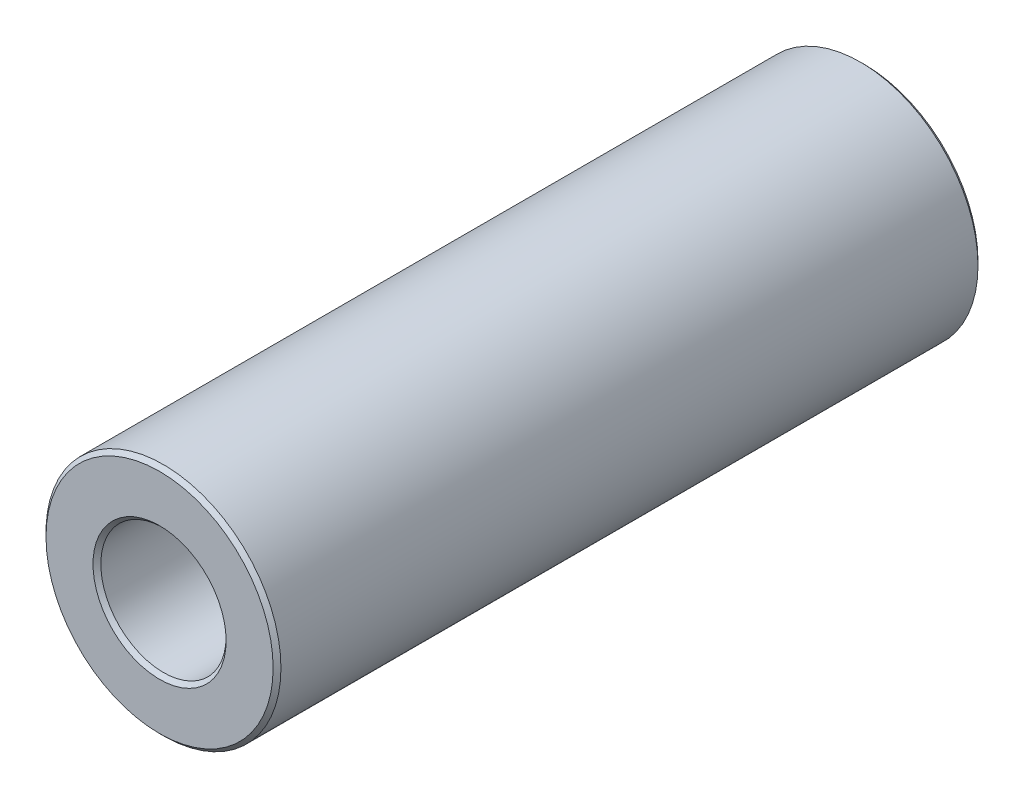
ISO-10303-21;
HEADER;
FILE_DESCRIPTION(('STEP AP214'),'2;1');
FILE_NAME('part.step','',(''),(''),'','','');
FILE_SCHEMA(('AUTOMOTIVE_DESIGN { 1 0 10303 214 1 1 1 1 }'));
ENDSEC;
DATA;
#1=APPLICATION_CONTEXT('core data for automotive mechanical design processes');
#2=APPLICATION_PROTOCOL_DEFINITION('international standard','automotive_design',2000,#1);
#3=PRODUCT_CONTEXT('',#1,'mechanical');
#4=PRODUCT('Part','Part','',(#3));
#5=PRODUCT_RELATED_PRODUCT_CATEGORY('part','',(#4));
#6=PRODUCT_DEFINITION_FORMATION('','',#4);
#7=PRODUCT_DEFINITION_CONTEXT('part definition',#1,'design');
#8=PRODUCT_DEFINITION('design','',#6,#7);
#9=PRODUCT_DEFINITION_SHAPE('','',#8);
#10=(LENGTH_UNIT() NAMED_UNIT(*) SI_UNIT(.MILLI.,.METRE.));
#11=(NAMED_UNIT(*) PLANE_ANGLE_UNIT() SI_UNIT($,.RADIAN.));
#12=(NAMED_UNIT(*) SI_UNIT($,.STERADIAN.) SOLID_ANGLE_UNIT());
#13=UNCERTAINTY_MEASURE_WITH_UNIT(LENGTH_MEASURE(1.E-05),#10,'distance_accuracy_value','');
#14=(GEOMETRIC_REPRESENTATION_CONTEXT(3) GLOBAL_UNCERTAINTY_ASSIGNED_CONTEXT((#13)) GLOBAL_UNIT_ASSIGNED_CONTEXT((#10,
#11,#12)) REPRESENTATION_CONTEXT('',''));
#15=CARTESIAN_POINT('',(0.,0.,0.));
#16=DIRECTION('',(0.,0.,1.));
#17=DIRECTION('',(1.,0.,0.));
#18=AXIS2_PLACEMENT_3D('',#15,#16,#17);
#19=CARTESIAN_POINT('',(0.,0.,9.));
#20=DIRECTION('',(0.,0.,1.));
#21=DIRECTION('',(1.,0.,0.));
#22=AXIS2_PLACEMENT_3D('',#19,#20,#21);
#23=PLANE('',#22);
#24=CARTESIAN_POINT('',(0.,0.,9.));
#25=DIRECTION('',(0.,0.,1.));
#26=DIRECTION('',(1.,0.,0.));
#27=AXIS2_PLACEMENT_3D('',#24,#25,#26);
#28=CIRCLE('',#27,1.7);
#29=CARTESIAN_POINT('',(1.7,0.,9.));
#30=VERTEX_POINT('',#29);
#31=EDGE_CURVE('E10',#30,#30,#28,.F.);
#32=ORIENTED_EDGE('',*,*,#31,.T.);
#33=EDGE_LOOP('',(#32));
#34=FACE_BOUND('',#33,.T.);
#35=CARTESIAN_POINT('',(0.,0.,9.));
#36=DIRECTION('',(0.,0.,1.));
#37=DIRECTION('',(1.,0.,0.));
#38=AXIS2_PLACEMENT_3D('',#35,#36,#37);
#39=CIRCLE('',#38,2.9);
#40=CARTESIAN_POINT('',(2.9,0.,9.));
#41=VERTEX_POINT('',#40);
#42=EDGE_CURVE('E45',#41,#41,#39,.T.);
#43=ORIENTED_EDGE('',*,*,#42,.T.);
#44=EDGE_LOOP('',(#43));
#45=FACE_BOUND('',#44,.T.);
#46=ADVANCED_FACE('F37',(#34,#45),#23,.T.);
#47=CARTESIAN_POINT('',(0.,0.,-9.));
#48=DIRECTION('',(0.,0.,1.));
#49=DIRECTION('',(1.,0.,0.));
#50=AXIS2_PLACEMENT_3D('',#47,#48,#49);
#51=PLANE('',#50);
#52=CARTESIAN_POINT('',(0.,0.,-9.));
#53=DIRECTION('',(0.,0.,1.));
#54=DIRECTION('',(1.,0.,0.));
#55=AXIS2_PLACEMENT_3D('',#52,#53,#54);
#56=CIRCLE('',#55,2.9);
#57=CARTESIAN_POINT('',(2.9,0.,-9.));
#58=VERTEX_POINT('',#57);
#59=EDGE_CURVE('E61',#58,#58,#56,.F.);
#60=ORIENTED_EDGE('',*,*,#59,.T.);
#61=EDGE_LOOP('',(#60));
#62=FACE_BOUND('',#61,.T.);
#63=CARTESIAN_POINT('',(0.,0.,-9.));
#64=DIRECTION('',(0.,0.,1.));
#65=DIRECTION('',(1.,0.,0.));
#66=AXIS2_PLACEMENT_3D('',#63,#64,#65);
#67=CIRCLE('',#66,1.7);
#68=CARTESIAN_POINT('',(1.7,0.,-9.));
#69=VERTEX_POINT('',#68);
#70=EDGE_CURVE('E65',#69,#69,#67,.T.);
#71=ORIENTED_EDGE('',*,*,#70,.T.);
#72=EDGE_LOOP('',(#71));
#73=FACE_BOUND('',#72,.T.);
#74=ADVANCED_FACE('F89',(#62,#73),#51,.F.);
#75=CARTESIAN_POINT('',(0.,0.,9.));
#76=DIRECTION('',(0.,0.,-1.));
#77=DIRECTION('',(-1.,0.,0.));
#78=AXIS2_PLACEMENT_3D('',#75,#76,#77);
#79=CYLINDRICAL_SURFACE('',#78,3.);
#80=CARTESIAN_POINT('',(0.,0.,-8.9));
#81=DIRECTION('',(0.,0.,1.));
#82=DIRECTION('',(1.,0.,0.));
#83=AXIS2_PLACEMENT_3D('',#80,#81,#82);
#84=CIRCLE('',#83,3.);
#85=CARTESIAN_POINT('',(3.,0.,-8.9));
#86=VERTEX_POINT('',#85);
#87=EDGE_CURVE('E69',#86,#86,#84,.T.);
#88=ORIENTED_EDGE('',*,*,#87,.T.);
#89=EDGE_LOOP('',(#88));
#90=FACE_BOUND('',#89,.T.);
#91=CARTESIAN_POINT('',(0.,0.,8.9));
#92=DIRECTION('',(0.,0.,1.));
#93=DIRECTION('',(1.,0.,0.));
#94=AXIS2_PLACEMENT_3D('',#91,#92,#93);
#95=CIRCLE('',#94,3.);
#96=CARTESIAN_POINT('',(3.,0.,8.9));
#97=VERTEX_POINT('',#96);
#98=EDGE_CURVE('E73',#97,#97,#95,.F.);
#99=ORIENTED_EDGE('',*,*,#98,.T.);
#100=EDGE_LOOP('',(#99));
#101=FACE_BOUND('',#100,.T.);
#102=ADVANCED_FACE('F78',(#90,#101),#79,.T.);
#103=CARTESIAN_POINT('',(0.,0.,9.));
#104=DIRECTION('',(0.,0.,-1.));
#105=DIRECTION('',(-1.,0.,0.));
#106=AXIS2_PLACEMENT_3D('',#103,#104,#105);
#107=CYLINDRICAL_SURFACE('',#106,1.6);
#108=CARTESIAN_POINT('',(0.,0.,-8.9));
#109=DIRECTION('',(0.,0.,1.));
#110=DIRECTION('',(1.,0.,0.));
#111=AXIS2_PLACEMENT_3D('',#108,#109,#110);
#112=CIRCLE('',#111,1.6);
#113=CARTESIAN_POINT('',(1.6,0.,-8.9));
#114=VERTEX_POINT('',#113);
#115=EDGE_CURVE('E51',#114,#114,#112,.F.);
#116=ORIENTED_EDGE('',*,*,#115,.T.);
#117=EDGE_LOOP('',(#116));
#118=FACE_BOUND('',#117,.T.);
#119=CARTESIAN_POINT('',(0.,0.,8.9));
#120=DIRECTION('',(0.,0.,1.));
#121=DIRECTION('',(1.,0.,0.));
#122=AXIS2_PLACEMENT_3D('',#119,#120,#121);
#123=CIRCLE('',#122,1.6);
#124=CARTESIAN_POINT('',(1.6,0.,8.9));
#125=VERTEX_POINT('',#124);
#126=EDGE_CURVE('E56',#125,#125,#123,.T.);
#127=ORIENTED_EDGE('',*,*,#126,.T.);
#128=EDGE_LOOP('',(#127));
#129=FACE_BOUND('',#128,.T.);
#130=ADVANCED_FACE('F97',(#118,#129),#107,.F.);
#131=CARTESIAN_POINT('',(0.,0.,-8.9));
#132=DIRECTION('',(0.,0.,1.));
#133=DIRECTION('',(1.,0.,0.));
#134=AXIS2_PLACEMENT_3D('',#131,#132,#133);
#135=CONICAL_SURFACE('',#134,3.,0.785398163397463);
#136=ORIENTED_EDGE('',*,*,#59,.F.);
#137=EDGE_LOOP('',(#136));
#138=FACE_BOUND('',#137,.T.);
#139=ORIENTED_EDGE('',*,*,#87,.F.);
#140=EDGE_LOOP('',(#139));
#141=FACE_BOUND('',#140,.T.);
#142=ADVANCED_FACE('F102',(#138,#141),#135,.T.);
#143=CARTESIAN_POINT('',(0.,0.,-9.));
#144=DIRECTION('',(0.,0.,-1.));
#145=DIRECTION('',(-1.,0.,0.));
#146=AXIS2_PLACEMENT_3D('',#143,#144,#145);
#147=CONICAL_SURFACE('',#146,1.7,0.78539816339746);
#148=ORIENTED_EDGE('',*,*,#115,.F.);
#149=EDGE_LOOP('',(#148));
#150=FACE_BOUND('',#149,.T.);
#151=ORIENTED_EDGE('',*,*,#70,.F.);
#152=EDGE_LOOP('',(#151));
#153=FACE_BOUND('',#152,.T.);
#154=ADVANCED_FACE('F86',(#150,#153),#147,.F.);
#155=CARTESIAN_POINT('',(0.,0.,8.9));
#156=DIRECTION('',(0.,0.,1.));
#157=DIRECTION('',(1.,0.,0.));
#158=AXIS2_PLACEMENT_3D('',#155,#156,#157);
#159=CONICAL_SURFACE('',#158,1.6,0.785398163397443);
#160=ORIENTED_EDGE('',*,*,#31,.F.);
#161=EDGE_LOOP('',(#160));
#162=FACE_BOUND('',#161,.T.);
#163=ORIENTED_EDGE('',*,*,#126,.F.);
#164=EDGE_LOOP('',(#163));
#165=FACE_BOUND('',#164,.T.);
#166=ADVANCED_FACE('F82',(#162,#165),#159,.F.);
#167=CARTESIAN_POINT('',(0.,0.,9.));
#168=DIRECTION('',(0.,0.,-1.));
#169=DIRECTION('',(-1.,0.,0.));
#170=AXIS2_PLACEMENT_3D('',#167,#168,#169);
#171=CONICAL_SURFACE('',#170,2.9,0.785398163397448);
#172=ORIENTED_EDGE('',*,*,#98,.F.);
#173=EDGE_LOOP('',(#172));
#174=FACE_BOUND('',#173,.T.);
#175=ORIENTED_EDGE('',*,*,#42,.F.);
#176=EDGE_LOOP('',(#175));
#177=FACE_BOUND('',#176,.T.);
#178=ADVANCED_FACE('F39',(#174,#177),#171,.T.);
#179=CLOSED_SHELL('',(#46,#74,#102,#130,#142,#154,#166,#178));
#180=MANIFOLD_SOLID_BREP('B2',#179);
#181=ADVANCED_BREP_SHAPE_REPRESENTATION('',(#18,#180),#14);
#182=SHAPE_DEFINITION_REPRESENTATION(#9,#181);
ENDSEC;
END-ISO-10303-21;
